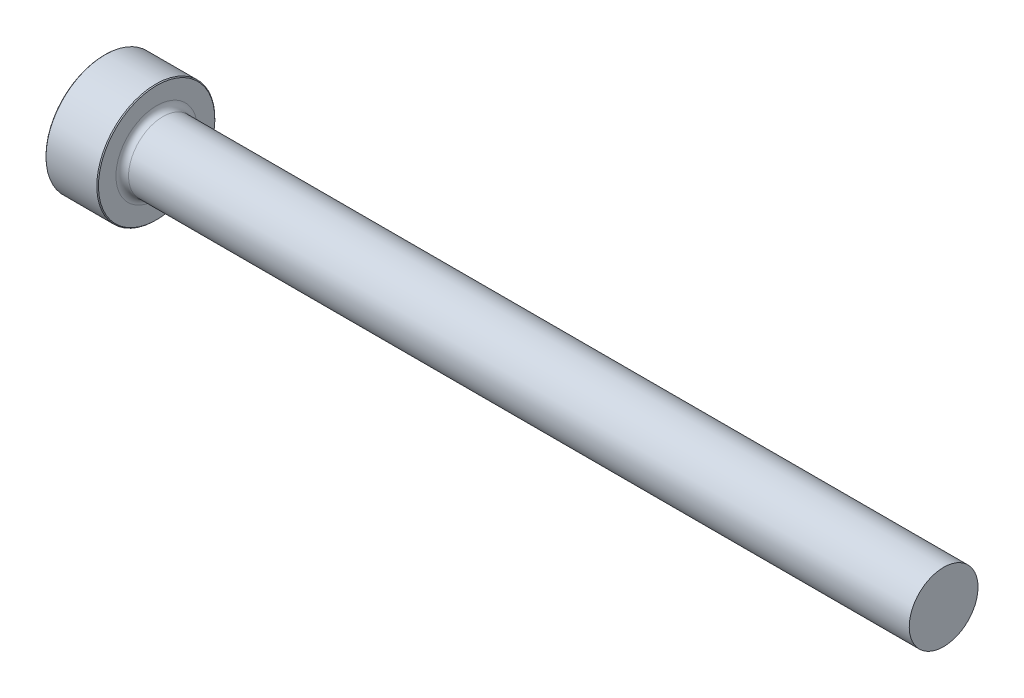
ISO-10303-21;
HEADER;
FILE_DESCRIPTION(('STEP AP214'),'2;1');
FILE_NAME('part.step','',(''),(''),'','','');
FILE_SCHEMA(('AUTOMOTIVE_DESIGN { 1 0 10303 214 1 1 1 1 }'));
ENDSEC;
DATA;
#1=APPLICATION_CONTEXT('core data for automotive mechanical design processes');
#2=APPLICATION_PROTOCOL_DEFINITION('international standard','automotive_design',2000,#1);
#3=PRODUCT_CONTEXT('',#1,'mechanical');
#4=PRODUCT('Part','Part','',(#3));
#5=PRODUCT_RELATED_PRODUCT_CATEGORY('part','',(#4));
#6=PRODUCT_DEFINITION_FORMATION('','',#4);
#7=PRODUCT_DEFINITION_CONTEXT('part definition',#1,'design');
#8=PRODUCT_DEFINITION('design','',#6,#7);
#9=PRODUCT_DEFINITION_SHAPE('','',#8);
#10=(LENGTH_UNIT() NAMED_UNIT(*) SI_UNIT(.MILLI.,.METRE.));
#11=(NAMED_UNIT(*) PLANE_ANGLE_UNIT() SI_UNIT($,.RADIAN.));
#12=(NAMED_UNIT(*) SI_UNIT($,.STERADIAN.) SOLID_ANGLE_UNIT());
#13=UNCERTAINTY_MEASURE_WITH_UNIT(LENGTH_MEASURE(1.E-05),#10,'distance_accuracy_value','');
#14=(GEOMETRIC_REPRESENTATION_CONTEXT(3) GLOBAL_UNCERTAINTY_ASSIGNED_CONTEXT((#13)) GLOBAL_UNIT_ASSIGNED_CONTEXT((#10,
#11,#12)) REPRESENTATION_CONTEXT('',''));
#15=CARTESIAN_POINT('',(0.,0.,0.));
#16=DIRECTION('',(0.,0.,1.));
#17=DIRECTION('',(1.,0.,0.));
#18=AXIS2_PLACEMENT_3D('',#15,#16,#17);
#19=CARTESIAN_POINT('',(101.6,4.16337749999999,0.));
#20=DIRECTION('',(1.,0.,0.));
#21=DIRECTION('',(0.,1.,0.));
#22=AXIS2_PLACEMENT_3D('',#19,#20,#21);
#23=PLANE('',#22);
#24=CARTESIAN_POINT('',(101.6,0.,0.));
#25=DIRECTION('',(1.,0.,0.));
#26=DIRECTION('',(0.,1.,0.));
#27=AXIS2_PLACEMENT_3D('',#24,#25,#26);
#28=CIRCLE('',#27,4.1633775);
#29=CARTESIAN_POINT('',(101.6,4.16337749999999,0.));
#30=VERTEX_POINT('',#29);
#31=EDGE_CURVE('E50',#30,#30,#28,.T.);
#32=ORIENTED_EDGE('',*,*,#31,.T.);
#33=EDGE_LOOP('',(#32));
#34=FACE_BOUND('',#33,.T.);
#35=ADVANCED_FACE('F30',(#34),#23,.T.);
#36=CARTESIAN_POINT('',(101.6,0.,0.));
#37=DIRECTION('',(1.,0.,0.));
#38=DIRECTION('',(0.,1.,0.));
#39=AXIS2_PLACEMENT_3D('',#36,#37,#38);
#40=CYLINDRICAL_SURFACE('',#39,4.1633775);
#41=CARTESIAN_POINT('',(7.11199999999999,0.,0.));
#42=DIRECTION('',(1.,0.,0.));
#43=DIRECTION('',(0.,1.,0.));
#44=AXIS2_PLACEMENT_3D('',#41,#42,#43);
#45=CIRCLE('',#44,4.16337749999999);
#46=CARTESIAN_POINT('',(7.11199999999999,4.16337749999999,0.));
#47=VERTEX_POINT('',#46);
#48=EDGE_CURVE('E53',#47,#47,#45,.T.);
#49=ORIENTED_EDGE('',*,*,#48,.T.);
#50=EDGE_LOOP('',(#49));
#51=FACE_BOUND('',#50,.T.);
#52=ORIENTED_EDGE('',*,*,#31,.F.);
#53=EDGE_LOOP('',(#52));
#54=FACE_BOUND('',#53,.T.);
#55=ADVANCED_FACE('F74',(#51,#54),#40,.T.);
#56=CARTESIAN_POINT('',(7.112,0.,0.));
#57=DIRECTION('',(1.,0.,0.));
#58=DIRECTION('',(0.,1.,0.));
#59=AXIS2_PLACEMENT_3D('',#56,#57,#58);
#60=TOROIDAL_SURFACE('',#59,4.92537749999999,0.762);
#61=CARTESIAN_POINT('',(6.34999999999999,0.,0.));
#62=DIRECTION('',(1.,0.,0.));
#63=DIRECTION('',(0.,1.,0.));
#64=AXIS2_PLACEMENT_3D('',#61,#62,#63);
#65=CIRCLE('',#64,4.92537749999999);
#66=CARTESIAN_POINT('',(6.34999999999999,4.92537749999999,0.));
#67=VERTEX_POINT('',#66);
#68=EDGE_CURVE('E56',#67,#67,#65,.T.);
#69=ORIENTED_EDGE('',*,*,#68,.T.);
#70=EDGE_LOOP('',(#69));
#71=FACE_BOUND('',#70,.T.);
#72=ORIENTED_EDGE('',*,*,#48,.F.);
#73=EDGE_LOOP('',(#72));
#74=FACE_BOUND('',#73,.T.);
#75=ADVANCED_FACE('F60',(#71,#74),#60,.F.);
#76=CARTESIAN_POINT('',(6.35,7.14375,0.));
#77=DIRECTION('',(1.,0.,0.));
#78=DIRECTION('',(0.,1.,0.));
#79=AXIS2_PLACEMENT_3D('',#76,#77,#78);
#80=PLANE('',#79);
#81=CARTESIAN_POINT('',(6.35,0.,0.));
#82=DIRECTION('',(1.,0.,0.));
#83=DIRECTION('',(0.,1.,0.));
#84=AXIS2_PLACEMENT_3D('',#81,#82,#83);
#85=CIRCLE('',#84,7.04215000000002);
#86=CARTESIAN_POINT('',(6.35,7.04215000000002,0.));
#87=VERTEX_POINT('',#86);
#88=EDGE_CURVE('E10',#87,#87,#85,.T.);
#89=ORIENTED_EDGE('',*,*,#88,.T.);
#90=EDGE_LOOP('',(#89));
#91=FACE_BOUND('',#90,.T.);
#92=ORIENTED_EDGE('',*,*,#68,.F.);
#93=EDGE_LOOP('',(#92));
#94=FACE_BOUND('',#93,.T.);
#95=ADVANCED_FACE('F63',(#91,#94),#80,.T.);
#96=CARTESIAN_POINT('',(101.6,0.,0.));
#97=DIRECTION('',(1.,0.,0.));
#98=DIRECTION('',(0.,1.,0.));
#99=AXIS2_PLACEMENT_3D('',#96,#97,#98);
#100=CYLINDRICAL_SURFACE('',#99,7.14375);
#101=CARTESIAN_POINT('',(0.101600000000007,0.,0.));
#102=DIRECTION('',(-1.,0.,0.));
#103=DIRECTION('',(0.,-1.,0.));
#104=AXIS2_PLACEMENT_3D('',#101,#102,#103);
#105=CIRCLE('',#104,7.14375);
#106=CARTESIAN_POINT('',(0.101600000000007,-7.14375,0.));
#107=VERTEX_POINT('',#106);
#108=EDGE_CURVE('E41',#107,#107,#105,.F.);
#109=ORIENTED_EDGE('',*,*,#108,.T.);
#110=EDGE_LOOP('',(#109));
#111=FACE_BOUND('',#110,.T.);
#112=CARTESIAN_POINT('',(6.24840000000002,0.,0.));
#113=DIRECTION('',(1.,0.,0.));
#114=DIRECTION('',(0.,1.,0.));
#115=AXIS2_PLACEMENT_3D('',#112,#113,#114);
#116=CIRCLE('',#115,7.14375);
#117=CARTESIAN_POINT('',(6.24840000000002,7.14375,0.));
#118=VERTEX_POINT('',#117);
#119=EDGE_CURVE('E45',#118,#118,#116,.F.);
#120=ORIENTED_EDGE('',*,*,#119,.T.);
#121=EDGE_LOOP('',(#120));
#122=FACE_BOUND('',#121,.T.);
#123=ADVANCED_FACE('F65',(#111,#122),#100,.T.);
#124=CARTESIAN_POINT('',(0.,0.,0.));
#125=DIRECTION('',(-1.,0.,0.));
#126=DIRECTION('',(0.,-1.,0.));
#127=AXIS2_PLACEMENT_3D('',#124,#125,#126);
#128=PLANE('',#127);
#129=CARTESIAN_POINT('',(0.,0.,0.));
#130=DIRECTION('',(-1.,0.,0.));
#131=DIRECTION('',(0.,-1.,0.));
#132=AXIS2_PLACEMENT_3D('',#129,#130,#131);
#133=CIRCLE('',#132,7.04215);
#134=CARTESIAN_POINT('',(0.,-7.04215,0.));
#135=VERTEX_POINT('',#134);
#136=EDGE_CURVE('E37',#135,#135,#133,.T.);
#137=ORIENTED_EDGE('',*,*,#136,.T.);
#138=EDGE_LOOP('',(#137));
#139=FACE_BOUND('',#138,.T.);
#140=ADVANCED_FACE('F71',(#139),#128,.T.);
#141=CARTESIAN_POINT('',(0.101600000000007,0.,0.));
#142=DIRECTION('',(1.,0.,0.));
#143=DIRECTION('',(0.,1.,0.));
#144=AXIS2_PLACEMENT_3D('',#141,#142,#143);
#145=CONICAL_SURFACE('',#144,7.14375,0.785398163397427);
#146=ORIENTED_EDGE('',*,*,#136,.F.);
#147=EDGE_LOOP('',(#146));
#148=FACE_BOUND('',#147,.T.);
#149=ORIENTED_EDGE('',*,*,#108,.F.);
#150=EDGE_LOOP('',(#149));
#151=FACE_BOUND('',#150,.T.);
#152=ADVANCED_FACE('F84',(#148,#151),#145,.T.);
#153=CARTESIAN_POINT('',(6.34999999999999,0.,0.));
#154=DIRECTION('',(-1.,0.,0.));
#155=DIRECTION('',(0.,-1.,0.));
#156=AXIS2_PLACEMENT_3D('',#153,#154,#155);
#157=CONICAL_SURFACE('',#156,7.04215000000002,0.785398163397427);
#158=ORIENTED_EDGE('',*,*,#119,.F.);
#159=EDGE_LOOP('',(#158));
#160=FACE_BOUND('',#159,.T.);
#161=ORIENTED_EDGE('',*,*,#88,.F.);
#162=EDGE_LOOP('',(#161));
#163=FACE_BOUND('',#162,.T.);
#164=ADVANCED_FACE('F32',(#160,#163),#157,.T.);
#165=CLOSED_SHELL('',(#35,#55,#75,#95,#123,#140,#152,#164));
#166=MANIFOLD_SOLID_BREP('B2',#165);
#167=ADVANCED_BREP_SHAPE_REPRESENTATION('',(#18,#166),#14);
#168=SHAPE_DEFINITION_REPRESENTATION(#9,#167);
ENDSEC;
END-ISO-10303-21;
